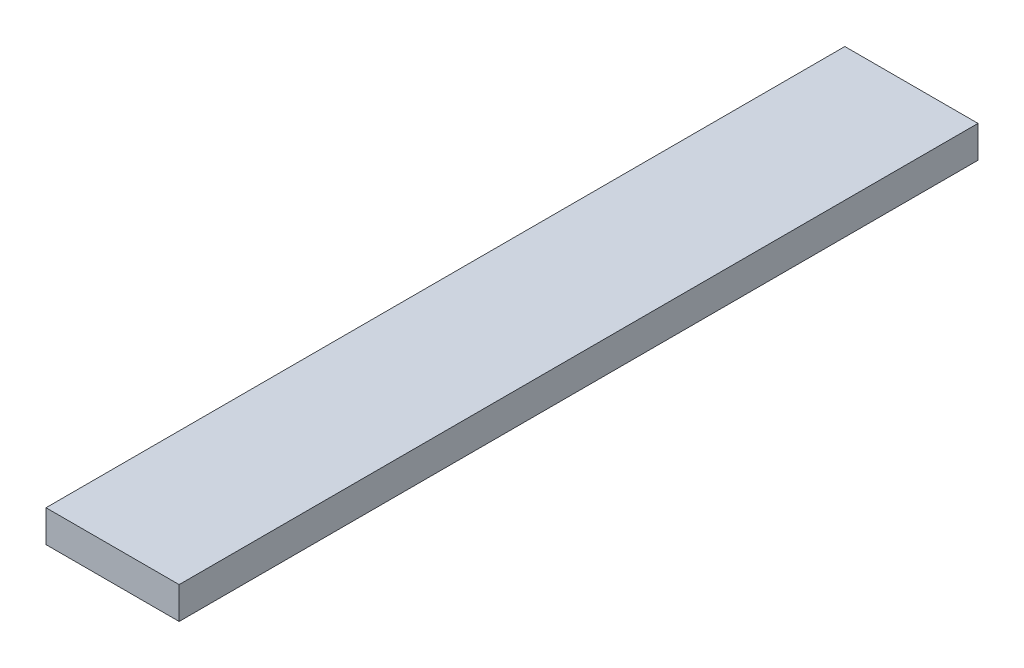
from build123d import *

# Parameters (mm, degrees)
SKETCH_1_W      = 50
SKETCH_1_H      = 12
EXTRUDE_1_DEPTH = 150


with BuildPart() as part:
    # Sketch 1 → Extrude 1 (new, symmetric)
    with BuildSketch(Plane.XY):
        Rectangle(SKETCH_1_W, SKETCH_1_H)
    extrude(amount=EXTRUDE_1_DEPTH, both=True)


solid = part.part
